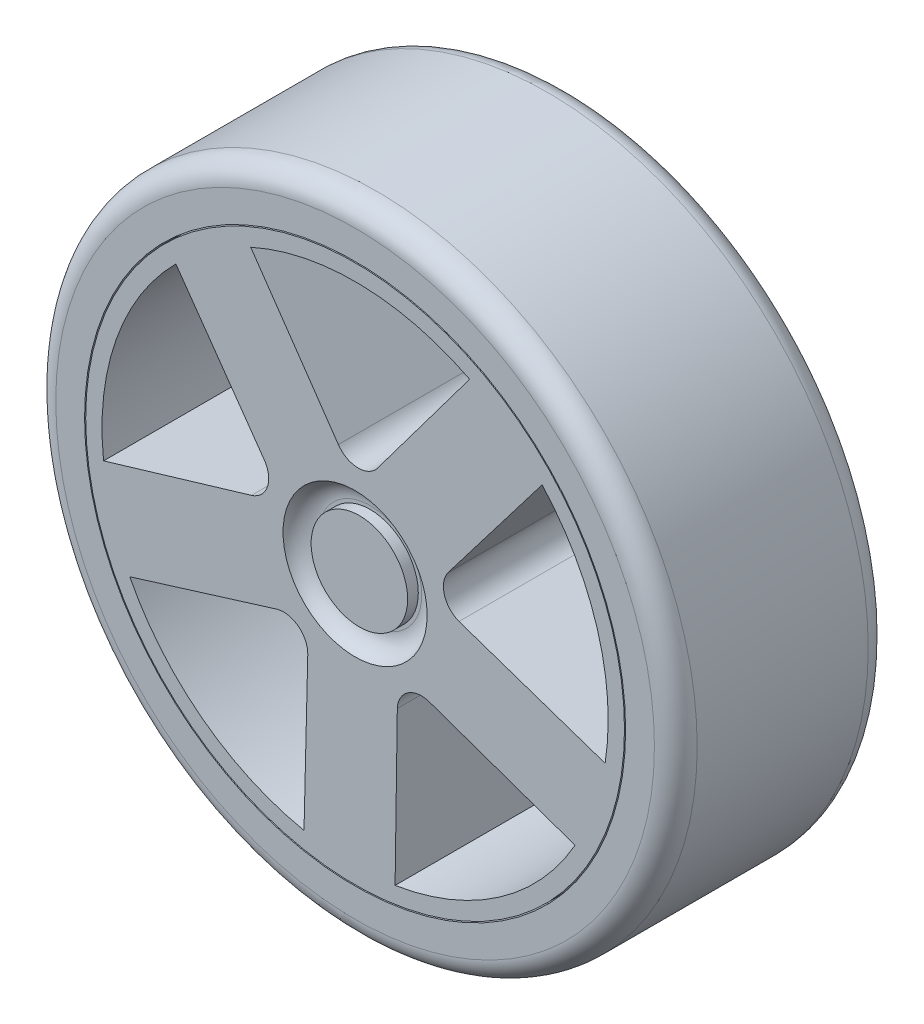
ISO-10303-21;
HEADER;
FILE_DESCRIPTION(('STEP AP214'),'2;1');
FILE_NAME('part.step','',(''),(''),'','','');
FILE_SCHEMA(('AUTOMOTIVE_DESIGN { 1 0 10303 214 1 1 1 1 }'));
ENDSEC;
DATA;
#1=APPLICATION_CONTEXT('core data for automotive mechanical design processes');
#2=APPLICATION_PROTOCOL_DEFINITION('international standard','automotive_design',2000,#1);
#3=PRODUCT_CONTEXT('',#1,'mechanical');
#4=PRODUCT('Part','Part','',(#3));
#5=PRODUCT_RELATED_PRODUCT_CATEGORY('part','',(#4));
#6=PRODUCT_DEFINITION_FORMATION('','',#4);
#7=PRODUCT_DEFINITION_CONTEXT('part definition',#1,'design');
#8=PRODUCT_DEFINITION('design','',#6,#7);
#9=PRODUCT_DEFINITION_SHAPE('','',#8);
#10=(LENGTH_UNIT() NAMED_UNIT(*) SI_UNIT(.MILLI.,.METRE.));
#11=(NAMED_UNIT(*) PLANE_ANGLE_UNIT() SI_UNIT($,.RADIAN.));
#12=(NAMED_UNIT(*) SI_UNIT($,.STERADIAN.) SOLID_ANGLE_UNIT());
#13=UNCERTAINTY_MEASURE_WITH_UNIT(LENGTH_MEASURE(1.E-05),#10,'distance_accuracy_value','');
#14=(GEOMETRIC_REPRESENTATION_CONTEXT(3) GLOBAL_UNCERTAINTY_ASSIGNED_CONTEXT((#13)) GLOBAL_UNIT_ASSIGNED_CONTEXT((#10,
#11,#12)) REPRESENTATION_CONTEXT('',''));
#15=CARTESIAN_POINT('',(0.,0.,0.));
#16=DIRECTION('',(0.,0.,1.));
#17=DIRECTION('',(1.,0.,0.));
#18=AXIS2_PLACEMENT_3D('',#15,#16,#17);
#19=CARTESIAN_POINT('',(0.,0.,25.4));
#20=DIRECTION('',(0.,0.,-1.));
#21=DIRECTION('',(-1.,0.,0.));
#22=AXIS2_PLACEMENT_3D('',#19,#20,#21);
#23=CYLINDRICAL_SURFACE('',#22,32.004);
#24=CARTESIAN_POINT('',(0.,0.,25.4));
#25=DIRECTION('',(0.,0.,1.));
#26=DIRECTION('',(1.,0.,0.));
#27=AXIS2_PLACEMENT_3D('',#24,#25,#26);
#28=CIRCLE('',#27,32.004);
#29=CARTESIAN_POINT('',(32.004,0.,25.4));
#30=VERTEX_POINT('',#29);
#31=EDGE_CURVE('E61',#30,#30,#28,.T.);
#32=ORIENTED_EDGE('',*,*,#31,.F.);
#33=EDGE_LOOP('',(#32));
#34=FACE_BOUND('',#33,.T.);
#35=CARTESIAN_POINT('',(0.,0.,0.));
#36=DIRECTION('',(0.,0.,1.));
#37=DIRECTION('',(1.,0.,0.));
#38=AXIS2_PLACEMENT_3D('',#35,#36,#37);
#39=CIRCLE('',#38,32.004);
#40=CARTESIAN_POINT('',(32.004,0.,0.));
#41=VERTEX_POINT('',#40);
#42=EDGE_CURVE('E401',#41,#41,#39,.T.);
#43=ORIENTED_EDGE('',*,*,#42,.T.);
#44=EDGE_LOOP('',(#43));
#45=FACE_BOUND('',#44,.T.);
#46=ADVANCED_FACE('F52',(#34,#45),#23,.T.);
#47=CARTESIAN_POINT('',(0.,0.,25.4));
#48=DIRECTION('',(0.,0.,1.));
#49=DIRECTION('',(1.,0.,0.));
#50=AXIS2_PLACEMENT_3D('',#47,#48,#49);
#51=PLANE('',#50);
#52=CARTESIAN_POINT('',(0.,0.,25.4));
#53=DIRECTION('',(0.,0.,1.));
#54=DIRECTION('',(1.,0.,0.));
#55=AXIS2_PLACEMENT_3D('',#52,#53,#54);
#56=CIRCLE('',#55,8.5593516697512);
#57=CARTESIAN_POINT('',(8.5593516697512,0.,25.4));
#58=VERTEX_POINT('',#57);
#59=EDGE_CURVE('E340',#58,#58,#56,.T.);
#60=ORIENTED_EDGE('',*,*,#59,.F.);
#61=EDGE_LOOP('',(#60));
#62=FACE_BOUND('',#61,.T.);
#63=CARTESIAN_POINT('',(0.,0.,25.4));
#64=DIRECTION('',(0.,0.,1.));
#65=DIRECTION('',(1.,0.,0.));
#66=AXIS2_PLACEMENT_3D('',#63,#64,#65);
#67=CIRCLE('',#66,30.0663789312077);
#68=CARTESIAN_POINT('',(-21.2941591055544,21.2260672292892,25.4));
#69=VERTEX_POINT('',#68);
#70=CARTESIAN_POINT('',(-29.8816345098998,-3.32792143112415,25.4));
#71=VERTEX_POINT('',#70);
#72=EDGE_CURVE('E68',#69,#71,#67,.T.);
#73=ORIENTED_EDGE('',*,*,#72,.F.);
#74=DIRECTION('',(-0.576069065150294,0.817401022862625,0.));
#75=VECTOR('',#74,1.);
#76=CARTESIAN_POINT('',(-10.7302632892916,6.236650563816,25.4));
#77=LINE('',#76,#75);
#78=CARTESIAN_POINT('',(-10.7302632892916,6.236650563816,25.4));
#79=VERTEX_POINT('',#78);
#80=EDGE_CURVE('E341',#79,#69,#77,.T.);
#81=ORIENTED_EDGE('',*,*,#80,.F.);
#82=CARTESIAN_POINT('',(-13.1276531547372,4.66047215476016,25.4));
#83=DIRECTION('',(0.,0.,1.));
#84=DIRECTION('',(1.,0.,0.));
#85=AXIS2_PLACEMENT_3D('',#82,#83,#84);
#86=CIRCLE('',#85,2.86911424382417);
#87=CARTESIAN_POINT('',(-12.3079916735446,1.91093190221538,25.4));
#88=VERTEX_POINT('',#87);
#89=EDGE_CURVE('E345',#88,#79,#86,.T.);
#90=ORIENTED_EDGE('',*,*,#89,.F.);
#91=DIRECTION('',(0.958323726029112,0.285684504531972,0.));
#92=VECTOR('',#91,1.);
#93=CARTESIAN_POINT('',(-29.8816345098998,-3.32792143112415,25.4));
#94=LINE('',#93,#92);
#95=EDGE_CURVE('E350',#71,#88,#94,.T.);
#96=ORIENTED_EDGE('',*,*,#95,.F.);
#97=EDGE_LOOP('',(#73,#81,#90,#96));
#98=FACE_BOUND('',#97,.T.);
#99=CARTESIAN_POINT('',(0.,0.,25.4));
#100=DIRECTION('',(0.,0.,1.));
#101=DIRECTION('',(1.,0.,0.));
#102=AXIS2_PLACEMENT_3D('',#99,#100,#101);
#103=CIRCLE('',#102,30.0663789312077);
#104=CARTESIAN_POINT('',(-26.7674465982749,-13.6927332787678,25.4));
#105=VERTEX_POINT('',#104);
#106=CARTESIAN_POINT('',(-6.06889152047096,-29.4475074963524,25.4));
#107=VERTEX_POINT('',#106);
#108=EDGE_CURVE('E76',#105,#107,#103,.T.);
#109=ORIENTED_EDGE('',*,*,#108,.F.);
#110=DIRECTION('',(-0.955409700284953,-0.295283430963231,0.));
#111=VECTOR('',#110,1.);
#112=CARTESIAN_POINT('',(-9.24724086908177,-8.27785581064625,25.4));
#113=LINE('',#112,#111);
#114=CARTESIAN_POINT('',(-9.24724086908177,-8.27785581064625,25.4));
#115=VERTEX_POINT('',#114);
#116=EDGE_CURVE('E298',#115,#105,#113,.T.);
#117=ORIENTED_EDGE('',*,*,#116,.F.);
#118=CARTESIAN_POINT('',(-8.48904033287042,-11.0449749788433,25.4));
#119=DIRECTION('',(0.,0.,1.));
#120=DIRECTION('',(1.,0.,0.));
#121=AXIS2_PLACEMENT_3D('',#118,#119,#120);
#122=CIRCLE('',#121,2.86911424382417);
#123=CARTESIAN_POINT('',(-5.62078283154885,-11.1150852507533,25.4));
#124=VERTEX_POINT('',#123);
#125=EDGE_CURVE('E302',#124,#115,#122,.T.);
#126=ORIENTED_EDGE('',*,*,#125,.F.);
#127=DIRECTION('',(0.02443620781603,0.999701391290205,0.));
#128=VECTOR('',#127,1.);
#129=CARTESIAN_POINT('',(-6.06889152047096,-29.4475074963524,25.4));
#130=LINE('',#129,#128);
#131=EDGE_CURVE('E307',#107,#124,#130,.T.);
#132=ORIENTED_EDGE('',*,*,#131,.F.);
#133=EDGE_LOOP('',(#109,#117,#126,#132));
#134=FACE_BOUND('',#133,.T.);
#135=CARTESIAN_POINT('',(0.,0.,25.4));
#136=DIRECTION('',(0.,0.,1.));
#137=DIRECTION('',(1.,0.,0.));
#138=AXIS2_PLACEMENT_3D('',#135,#136,#137);
#139=CIRCLE('',#138,30.0663789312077);
#140=CARTESIAN_POINT('',(4.75096731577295,-29.6886417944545,25.4));
#141=VERTEX_POINT('',#140);
#142=CARTESIAN_POINT('',(26.1308532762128,-14.8716390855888,25.4));
#143=VERTEX_POINT('',#142);
#144=EDGE_CURVE('E202',#141,#143,#139,.T.);
#145=ORIENTED_EDGE('',*,*,#144,.F.);
#146=DIRECTION('',(-0.0144066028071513,-0.999896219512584,0.));
#147=VECTOR('',#146,1.);
#148=CARTESIAN_POINT('',(5.01515413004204,-11.3526468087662,25.4));
#149=LINE('',#148,#147);
#150=CARTESIAN_POINT('',(5.01515413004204,-11.3526468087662,25.4));
#151=VERTEX_POINT('',#150);
#152=EDGE_CURVE('E256',#151,#141,#149,.T.);
#153=ORIENTED_EDGE('',*,*,#152,.F.);
#154=CARTESIAN_POINT('',(7.88113769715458,-11.4866420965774,25.4));
#155=DIRECTION('',(0.,0.,1.));
#156=DIRECTION('',(1.,0.,0.));
#157=AXIS2_PLACEMENT_3D('',#154,#155,#156);
#158=CIRCLE('',#157,2.86911424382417);
#159=CARTESIAN_POINT('',(8.8341568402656,-8.78043237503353,25.4));
#160=VERTEX_POINT('',#159);
#161=EDGE_CURVE('E260',#160,#151,#158,.T.);
#162=ORIENTED_EDGE('',*,*,#161,.F.);
#163=DIRECTION('',(-0.943221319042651,0.332164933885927,0.));
#164=VECTOR('',#163,1.);
#165=CARTESIAN_POINT('',(26.1308532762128,-14.8716390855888,25.4));
#166=LINE('',#165,#164);
#167=EDGE_CURVE('E265',#143,#160,#166,.T.);
#168=ORIENTED_EDGE('',*,*,#167,.F.);
#169=EDGE_LOOP('',(#145,#153,#162,#168));
#170=FACE_BOUND('',#169,.T.);
#171=CARTESIAN_POINT('',(0.,0.,25.4));
#172=DIRECTION('',(0.,0.,1.));
#173=DIRECTION('',(1.,0.,0.));
#174=AXIS2_PLACEMENT_3D('',#171,#172,#173);
#175=CIRCLE('',#174,30.0663789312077);
#176=CARTESIAN_POINT('',(29.7037058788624,-4.65585643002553,25.4));
#177=VERTEX_POINT('',#176);
#178=CARTESIAN_POINT('',(22.2186470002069,20.2563290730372,25.4));
#179=VERTEX_POINT('',#178);
#180=EDGE_CURVE('E193',#177,#179,#175,.T.);
#181=ORIENTED_EDGE('',*,*,#180,.F.);
#182=DIRECTION('',(0.946505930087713,-0.322686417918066,0.));
#183=VECTOR('',#182,1.);
#184=CARTESIAN_POINT('',(12.3467765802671,1.26153422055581,25.4));
#185=LINE('',#184,#183);
#186=CARTESIAN_POINT('',(12.3467765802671,1.26153422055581,25.4));
#187=VERTEX_POINT('',#186);
#188=EDGE_CURVE('E205',#187,#177,#185,.T.);
#189=ORIENTED_EDGE('',*,*,#188,.F.);
#190=CARTESIAN_POINT('',(13.35985129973,3.94583974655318,25.4));
#191=DIRECTION('',(0.,0.,1.));
#192=DIRECTION('',(1.,0.,0.));
#193=AXIS2_PLACEMENT_3D('',#190,#191,#192);
#194=CIRCLE('',#193,2.86911424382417);
#195=CARTESIAN_POINT('',(11.0805920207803,5.6884796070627,25.4));
#196=VERTEX_POINT('',#195);
#197=EDGE_CURVE('E211',#196,#187,#194,.T.);
#198=ORIENTED_EDGE('',*,*,#197,.F.);
#199=DIRECTION('',(-0.607379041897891,-0.794412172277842,0.));
#200=VECTOR('',#199,1.);
#201=CARTESIAN_POINT('',(22.2186470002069,20.2563290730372,25.4));
#202=LINE('',#201,#200);
#203=EDGE_CURVE('E217',#179,#196,#202,.T.);
#204=ORIENTED_EDGE('',*,*,#203,.F.);
#205=EDGE_LOOP('',(#181,#189,#198,#204));
#206=FACE_BOUND('',#205,.T.);
#207=CARTESIAN_POINT('',(0.,0.,25.4));
#208=DIRECTION('',(0.,0.,1.));
#209=DIRECTION('',(1.,0.,0.));
#210=AXIS2_PLACEMENT_3D('',#207,#208,#209);
#211=CIRCLE('',#210,30.0663789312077);
#212=CARTESIAN_POINT('',(13.6069325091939,26.811164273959,25.4));
#213=VERTEX_POINT('',#212);
#214=CARTESIAN_POINT('',(-12.3989742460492,27.3907389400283,25.4));
#215=VERTEX_POINT('',#214);
#216=EDGE_CURVE('E219',#213,#215,#211,.T.);
#217=ORIENTED_EDGE('',*,*,#216,.F.);
#218=DIRECTION('',(0.599379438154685,0.800465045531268,0.));
#219=VECTOR('',#218,1.);
#220=CARTESIAN_POINT('',(2.61557344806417,12.1323178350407,25.4));
#221=LINE('',#220,#219);
#222=CARTESIAN_POINT('',(2.61557344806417,12.1323178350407,25.4));
#223=VERTEX_POINT('',#222);
#224=EDGE_CURVE('E375',#223,#213,#221,.T.);
#225=ORIENTED_EDGE('',*,*,#224,.F.);
#226=CARTESIAN_POINT('',(0.375704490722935,13.9253051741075,25.4));
#227=DIRECTION('',(0.,0.,1.));
#228=DIRECTION('',(1.,0.,0.));
#229=AXIS2_PLACEMENT_3D('',#226,#227,#228);
#230=CIRCLE('',#229,2.86911424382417);
#231=CARTESIAN_POINT('',(-1.98597435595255,12.2961061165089,25.4));
#232=VERTEX_POINT('',#231);
#233=EDGE_CURVE('E391',#232,#223,#230,.T.);
#234=ORIENTED_EDGE('',*,*,#233,.F.);
#235=DIRECTION('',(0.567840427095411,-0.823138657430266,0.));
#236=VECTOR('',#235,1.);
#237=CARTESIAN_POINT('',(-12.3989742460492,27.3907389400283,25.4));
#238=LINE('',#237,#236);
#239=EDGE_CURVE('E223',#215,#232,#238,.T.);
#240=ORIENTED_EDGE('',*,*,#239,.F.);
#241=EDGE_LOOP('',(#217,#225,#234,#240));
#242=FACE_BOUND('',#241,.T.);
#243=ORIENTED_EDGE('',*,*,#31,.T.);
#244=EDGE_LOOP('',(#243));
#245=FACE_BOUND('',#244,.T.);
#246=ADVANCED_FACE('F214',(#62,#98,#134,#170,#206,#242,#245),#51,.T.);
#247=CARTESIAN_POINT('',(0.,0.,0.));
#248=DIRECTION('',(0.,0.,1.));
#249=DIRECTION('',(1.,0.,0.));
#250=AXIS2_PLACEMENT_3D('',#247,#248,#249);
#251=PLANE('',#250);
#252=CARTESIAN_POINT('',(0.,0.,0.));
#253=DIRECTION('',(0.,0.,-1.));
#254=DIRECTION('',(-1.,0.,0.));
#255=AXIS2_PLACEMENT_3D('',#252,#253,#254);
#256=CIRCLE('',#255,1.778);
#257=CARTESIAN_POINT('',(-1.778,0.,0.));
#258=VERTEX_POINT('',#257);
#259=EDGE_CURVE('E764',#258,#258,#256,.T.);
#260=ORIENTED_EDGE('',*,*,#259,.F.);
#261=EDGE_LOOP('',(#260));
#262=FACE_BOUND('',#261,.T.);
#263=DIRECTION('',(-0.576069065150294,0.817401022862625,0.));
#264=VECTOR('',#263,1.);
#265=CARTESIAN_POINT('',(-10.7302632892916,6.236650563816,0.));
#266=LINE('',#265,#264);
#267=CARTESIAN_POINT('',(-10.7302632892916,6.236650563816,0.));
#268=VERTEX_POINT('',#267);
#269=CARTESIAN_POINT('',(-21.2941591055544,21.2260672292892,0.));
#270=VERTEX_POINT('',#269);
#271=EDGE_CURVE('E330',#268,#270,#266,.T.);
#272=ORIENTED_EDGE('',*,*,#271,.T.);
#273=CARTESIAN_POINT('',(0.,0.,0.));
#274=DIRECTION('',(0.,0.,1.));
#275=DIRECTION('',(1.,0.,0.));
#276=AXIS2_PLACEMENT_3D('',#273,#274,#275);
#277=CIRCLE('',#276,30.0663789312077);
#278=CARTESIAN_POINT('',(-29.8816345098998,-3.32792143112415,0.));
#279=VERTEX_POINT('',#278);
#280=EDGE_CURVE('E346',#270,#279,#277,.T.);
#281=ORIENTED_EDGE('',*,*,#280,.T.);
#282=DIRECTION('',(0.958323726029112,0.285684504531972,0.));
#283=VECTOR('',#282,1.);
#284=CARTESIAN_POINT('',(-29.8816345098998,-3.32792143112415,0.));
#285=LINE('',#284,#283);
#286=CARTESIAN_POINT('',(-12.3079916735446,1.91093190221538,0.));
#287=VERTEX_POINT('',#286);
#288=EDGE_CURVE('E363',#279,#287,#285,.T.);
#289=ORIENTED_EDGE('',*,*,#288,.T.);
#290=CARTESIAN_POINT('',(-13.1276531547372,4.66047215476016,0.));
#291=DIRECTION('',(0.,0.,1.));
#292=DIRECTION('',(1.,0.,0.));
#293=AXIS2_PLACEMENT_3D('',#290,#291,#292);
#294=CIRCLE('',#293,2.86911424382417);
#295=EDGE_CURVE('E359',#287,#268,#294,.T.);
#296=ORIENTED_EDGE('',*,*,#295,.T.);
#297=EDGE_LOOP('',(#272,#281,#289,#296));
#298=FACE_BOUND('',#297,.T.);
#299=DIRECTION('',(-0.955409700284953,-0.295283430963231,0.));
#300=VECTOR('',#299,1.);
#301=CARTESIAN_POINT('',(-9.24724086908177,-8.27785581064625,0.));
#302=LINE('',#301,#300);
#303=CARTESIAN_POINT('',(-9.24724086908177,-8.27785581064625,0.));
#304=VERTEX_POINT('',#303);
#305=CARTESIAN_POINT('',(-26.7674465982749,-13.6927332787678,0.));
#306=VERTEX_POINT('',#305);
#307=EDGE_CURVE('E288',#304,#306,#302,.T.);
#308=ORIENTED_EDGE('',*,*,#307,.T.);
#309=CARTESIAN_POINT('',(0.,0.,0.));
#310=DIRECTION('',(0.,0.,1.));
#311=DIRECTION('',(1.,0.,0.));
#312=AXIS2_PLACEMENT_3D('',#309,#310,#311);
#313=CIRCLE('',#312,30.0663789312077);
#314=CARTESIAN_POINT('',(-6.06889152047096,-29.4475074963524,0.));
#315=VERTEX_POINT('',#314);
#316=EDGE_CURVE('E303',#306,#315,#313,.T.);
#317=ORIENTED_EDGE('',*,*,#316,.T.);
#318=DIRECTION('',(0.02443620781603,0.999701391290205,0.));
#319=VECTOR('',#318,1.);
#320=CARTESIAN_POINT('',(-6.06889152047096,-29.4475074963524,0.));
#321=LINE('',#320,#319);
#322=CARTESIAN_POINT('',(-5.62078283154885,-11.1150852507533,0.));
#323=VERTEX_POINT('',#322);
#324=EDGE_CURVE('E320',#315,#323,#321,.T.);
#325=ORIENTED_EDGE('',*,*,#324,.T.);
#326=CARTESIAN_POINT('',(-8.48904033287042,-11.0449749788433,0.));
#327=DIRECTION('',(0.,0.,1.));
#328=DIRECTION('',(1.,0.,0.));
#329=AXIS2_PLACEMENT_3D('',#326,#327,#328);
#330=CIRCLE('',#329,2.86911424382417);
#331=EDGE_CURVE('E316',#323,#304,#330,.T.);
#332=ORIENTED_EDGE('',*,*,#331,.T.);
#333=EDGE_LOOP('',(#308,#317,#325,#332));
#334=FACE_BOUND('',#333,.T.);
#335=DIRECTION('',(-0.0144066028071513,-0.999896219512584,0.));
#336=VECTOR('',#335,1.);
#337=CARTESIAN_POINT('',(5.01515413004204,-11.3526468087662,0.));
#338=LINE('',#337,#336);
#339=CARTESIAN_POINT('',(5.01515413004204,-11.3526468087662,0.));
#340=VERTEX_POINT('',#339);
#341=CARTESIAN_POINT('',(4.75096731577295,-29.6886417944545,0.));
#342=VERTEX_POINT('',#341);
#343=EDGE_CURVE('E246',#340,#342,#338,.T.);
#344=ORIENTED_EDGE('',*,*,#343,.T.);
#345=CARTESIAN_POINT('',(0.,0.,0.));
#346=DIRECTION('',(0.,0.,1.));
#347=DIRECTION('',(1.,0.,0.));
#348=AXIS2_PLACEMENT_3D('',#345,#346,#347);
#349=CIRCLE('',#348,30.0663789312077);
#350=CARTESIAN_POINT('',(26.1308532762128,-14.8716390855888,0.));
#351=VERTEX_POINT('',#350);
#352=EDGE_CURVE('E261',#342,#351,#349,.T.);
#353=ORIENTED_EDGE('',*,*,#352,.T.);
#354=DIRECTION('',(-0.943221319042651,0.332164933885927,0.));
#355=VECTOR('',#354,1.);
#356=CARTESIAN_POINT('',(26.1308532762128,-14.8716390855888,0.));
#357=LINE('',#356,#355);
#358=CARTESIAN_POINT('',(8.83415684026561,-8.78043237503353,0.));
#359=VERTEX_POINT('',#358);
#360=EDGE_CURVE('E278',#351,#359,#357,.T.);
#361=ORIENTED_EDGE('',*,*,#360,.T.);
#362=CARTESIAN_POINT('',(7.88113769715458,-11.4866420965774,0.));
#363=DIRECTION('',(0.,0.,1.));
#364=DIRECTION('',(1.,0.,0.));
#365=AXIS2_PLACEMENT_3D('',#362,#363,#364);
#366=CIRCLE('',#365,2.86911424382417);
#367=EDGE_CURVE('E274',#359,#340,#366,.T.);
#368=ORIENTED_EDGE('',*,*,#367,.T.);
#369=EDGE_LOOP('',(#344,#353,#361,#368));
#370=FACE_BOUND('',#369,.T.);
#371=DIRECTION('',(0.946505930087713,-0.322686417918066,0.));
#372=VECTOR('',#371,1.);
#373=CARTESIAN_POINT('',(12.3467765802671,1.26153422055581,0.));
#374=LINE('',#373,#372);
#375=CARTESIAN_POINT('',(12.3467765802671,1.26153422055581,0.));
#376=VERTEX_POINT('',#375);
#377=CARTESIAN_POINT('',(29.7037058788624,-4.65585643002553,0.));
#378=VERTEX_POINT('',#377);
#379=EDGE_CURVE('E228',#376,#378,#374,.T.);
#380=ORIENTED_EDGE('',*,*,#379,.T.);
#381=CARTESIAN_POINT('',(0.,0.,0.));
#382=DIRECTION('',(0.,0.,1.));
#383=DIRECTION('',(1.,0.,0.));
#384=AXIS2_PLACEMENT_3D('',#381,#382,#383);
#385=CIRCLE('',#384,30.0663789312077);
#386=CARTESIAN_POINT('',(22.2186470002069,20.2563290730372,0.));
#387=VERTEX_POINT('',#386);
#388=EDGE_CURVE('E196',#378,#387,#385,.T.);
#389=ORIENTED_EDGE('',*,*,#388,.T.);
#390=DIRECTION('',(-0.607379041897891,-0.794412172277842,0.));
#391=VECTOR('',#390,1.);
#392=CARTESIAN_POINT('',(22.2186470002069,20.2563290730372,0.));
#393=LINE('',#392,#391);
#394=CARTESIAN_POINT('',(11.0805920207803,5.6884796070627,0.));
#395=VERTEX_POINT('',#394);
#396=EDGE_CURVE('E236',#387,#395,#393,.T.);
#397=ORIENTED_EDGE('',*,*,#396,.T.);
#398=CARTESIAN_POINT('',(13.35985129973,3.94583974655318,0.));
#399=DIRECTION('',(0.,0.,1.));
#400=DIRECTION('',(1.,0.,0.));
#401=AXIS2_PLACEMENT_3D('',#398,#399,#400);
#402=CIRCLE('',#401,2.86911424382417);
#403=EDGE_CURVE('E231',#395,#376,#402,.T.);
#404=ORIENTED_EDGE('',*,*,#403,.T.);
#405=EDGE_LOOP('',(#380,#389,#397,#404));
#406=FACE_BOUND('',#405,.T.);
#407=DIRECTION('',(0.599379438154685,0.800465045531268,0.));
#408=VECTOR('',#407,1.);
#409=CARTESIAN_POINT('',(2.61557344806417,12.1323178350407,0.));
#410=LINE('',#409,#408);
#411=CARTESIAN_POINT('',(2.61557344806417,12.1323178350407,0.));
#412=VERTEX_POINT('',#411);
#413=CARTESIAN_POINT('',(13.6069325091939,26.811164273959,0.));
#414=VERTEX_POINT('',#413);
#415=EDGE_CURVE('E383',#412,#414,#410,.T.);
#416=ORIENTED_EDGE('',*,*,#415,.T.);
#417=CARTESIAN_POINT('',(0.,0.,0.));
#418=DIRECTION('',(0.,0.,1.));
#419=DIRECTION('',(1.,0.,0.));
#420=AXIS2_PLACEMENT_3D('',#417,#418,#419);
#421=CIRCLE('',#420,30.0663789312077);
#422=CARTESIAN_POINT('',(-12.3989742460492,27.3907389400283,0.));
#423=VERTEX_POINT('',#422);
#424=EDGE_CURVE('E370',#414,#423,#421,.T.);
#425=ORIENTED_EDGE('',*,*,#424,.T.);
#426=DIRECTION('',(0.567840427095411,-0.823138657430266,0.));
#427=VECTOR('',#426,1.);
#428=CARTESIAN_POINT('',(-12.3989742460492,27.3907389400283,0.));
#429=LINE('',#428,#427);
#430=CARTESIAN_POINT('',(-1.98597435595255,12.2961061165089,0.));
#431=VERTEX_POINT('',#430);
#432=EDGE_CURVE('E374',#423,#431,#429,.T.);
#433=ORIENTED_EDGE('',*,*,#432,.T.);
#434=CARTESIAN_POINT('',(0.375704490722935,13.9253051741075,0.));
#435=DIRECTION('',(0.,0.,1.));
#436=DIRECTION('',(1.,0.,0.));
#437=AXIS2_PLACEMENT_3D('',#434,#435,#436);
#438=CIRCLE('',#437,2.86911424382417);
#439=EDGE_CURVE('E379',#431,#412,#438,.T.);
#440=ORIENTED_EDGE('',*,*,#439,.T.);
#441=EDGE_LOOP('',(#416,#425,#433,#440));
#442=FACE_BOUND('',#441,.T.);
#443=ORIENTED_EDGE('',*,*,#42,.F.);
#444=EDGE_LOOP('',(#443));
#445=FACE_BOUND('',#444,.T.);
#446=ADVANCED_FACE('F418',(#262,#298,#334,#370,#406,#442,#445),#251,.F.);
#447=CARTESIAN_POINT('',(0.,0.,0.));
#448=DIRECTION('',(0.,0.,1.));
#449=DIRECTION('',(1.,0.,0.));
#450=AXIS2_PLACEMENT_3D('',#447,#448,#449);
#451=CYLINDRICAL_SURFACE('',#450,30.0663789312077);
#452=ORIENTED_EDGE('',*,*,#216,.T.);
#453=DIRECTION('',(0.,0.,1.));
#454=VECTOR('',#453,1.);
#455=CARTESIAN_POINT('',(-12.3989742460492,27.3907389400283,0.));
#456=LINE('',#455,#454);
#457=EDGE_CURVE('E386',#423,#215,#456,.T.);
#458=ORIENTED_EDGE('',*,*,#457,.F.);
#459=ORIENTED_EDGE('',*,*,#424,.F.);
#460=DIRECTION('',(0.,0.,1.));
#461=VECTOR('',#460,1.);
#462=CARTESIAN_POINT('',(13.6069325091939,26.811164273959,0.));
#463=LINE('',#462,#461);
#464=EDGE_CURVE('E398',#414,#213,#463,.T.);
#465=ORIENTED_EDGE('',*,*,#464,.T.);
#466=EDGE_LOOP('',(#452,#458,#459,#465));
#467=FACE_BOUND('',#466,.T.);
#468=ADVANCED_FACE('F420',(#467),#451,.F.);
#469=CARTESIAN_POINT('',(2.61557344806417,12.1323178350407,0.));
#470=DIRECTION('',(0.800465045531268,-0.599379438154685,0.));
#471=DIRECTION('',(0.599379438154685,0.800465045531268,0.));
#472=AXIS2_PLACEMENT_3D('',#469,#470,#471);
#473=PLANE('',#472);
#474=ORIENTED_EDGE('',*,*,#224,.T.);
#475=ORIENTED_EDGE('',*,*,#464,.F.);
#476=ORIENTED_EDGE('',*,*,#415,.F.);
#477=DIRECTION('',(0.,0.,1.));
#478=VECTOR('',#477,1.);
#479=CARTESIAN_POINT('',(2.61557344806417,12.1323178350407,0.));
#480=LINE('',#479,#478);
#481=EDGE_CURVE('E402',#412,#223,#480,.T.);
#482=ORIENTED_EDGE('',*,*,#481,.T.);
#483=EDGE_LOOP('',(#474,#475,#476,#482));
#484=FACE_BOUND('',#483,.T.);
#485=ADVANCED_FACE('F428',(#484),#473,.F.);
#486=CARTESIAN_POINT('',(0.375704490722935,13.9253051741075,0.));
#487=DIRECTION('',(0.,0.,1.));
#488=DIRECTION('',(1.,0.,0.));
#489=AXIS2_PLACEMENT_3D('',#486,#487,#488);
#490=CYLINDRICAL_SURFACE('',#489,2.86911424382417);
#491=ORIENTED_EDGE('',*,*,#233,.T.);
#492=ORIENTED_EDGE('',*,*,#481,.F.);
#493=ORIENTED_EDGE('',*,*,#439,.F.);
#494=DIRECTION('',(0.,0.,1.));
#495=VECTOR('',#494,1.);
#496=CARTESIAN_POINT('',(-1.98597435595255,12.2961061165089,0.));
#497=LINE('',#496,#495);
#498=EDGE_CURVE('E405',#431,#232,#497,.T.);
#499=ORIENTED_EDGE('',*,*,#498,.T.);
#500=EDGE_LOOP('',(#491,#492,#493,#499));
#501=FACE_BOUND('',#500,.T.);
#502=ADVANCED_FACE('F463',(#501),#490,.F.);
#503=CARTESIAN_POINT('',(-12.3989742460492,27.3907389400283,0.));
#504=DIRECTION('',(-0.823138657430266,-0.567840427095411,0.));
#505=DIRECTION('',(0.567840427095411,-0.823138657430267,0.));
#506=AXIS2_PLACEMENT_3D('',#503,#504,#505);
#507=PLANE('',#506);
#508=ORIENTED_EDGE('',*,*,#239,.T.);
#509=ORIENTED_EDGE('',*,*,#498,.F.);
#510=ORIENTED_EDGE('',*,*,#432,.F.);
#511=ORIENTED_EDGE('',*,*,#457,.T.);
#512=EDGE_LOOP('',(#508,#509,#510,#511));
#513=FACE_BOUND('',#512,.T.);
#514=ADVANCED_FACE('F471',(#513),#507,.F.);
#515=CARTESIAN_POINT('',(0.,0.,0.));
#516=DIRECTION('',(0.,0.,1.));
#517=DIRECTION('',(1.,0.,0.));
#518=AXIS2_PLACEMENT_3D('',#515,#516,#517);
#519=CYLINDRICAL_SURFACE('',#518,30.0663789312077);
#520=ORIENTED_EDGE('',*,*,#180,.T.);
#521=DIRECTION('',(0.,0.,1.));
#522=VECTOR('',#521,1.);
#523=CARTESIAN_POINT('',(22.2186470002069,20.2563290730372,0.));
#524=LINE('',#523,#522);
#525=EDGE_CURVE('E232',#387,#179,#524,.T.);
#526=ORIENTED_EDGE('',*,*,#525,.F.);
#527=ORIENTED_EDGE('',*,*,#388,.F.);
#528=DIRECTION('',(0.,0.,1.));
#529=VECTOR('',#528,1.);
#530=CARTESIAN_POINT('',(29.7037058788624,-4.65585643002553,0.));
#531=LINE('',#530,#529);
#532=EDGE_CURVE('E189',#378,#177,#531,.T.);
#533=ORIENTED_EDGE('',*,*,#532,.T.);
#534=EDGE_LOOP('',(#520,#526,#527,#533));
#535=FACE_BOUND('',#534,.T.);
#536=ADVANCED_FACE('F191',(#535),#519,.F.);
#537=CARTESIAN_POINT('',(12.3467765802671,1.26153422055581,0.));
#538=DIRECTION('',(-0.322686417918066,-0.946505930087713,0.));
#539=DIRECTION('',(0.946505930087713,-0.322686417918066,0.));
#540=AXIS2_PLACEMENT_3D('',#537,#538,#539);
#541=PLANE('',#540);
#542=ORIENTED_EDGE('',*,*,#188,.T.);
#543=ORIENTED_EDGE('',*,*,#532,.F.);
#544=ORIENTED_EDGE('',*,*,#379,.F.);
#545=DIRECTION('',(0.,0.,1.));
#546=VECTOR('',#545,1.);
#547=CARTESIAN_POINT('',(12.3467765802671,1.26153422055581,0.));
#548=LINE('',#547,#546);
#549=EDGE_CURVE('E201',#376,#187,#548,.T.);
#550=ORIENTED_EDGE('',*,*,#549,.T.);
#551=EDGE_LOOP('',(#542,#543,#544,#550));
#552=FACE_BOUND('',#551,.T.);
#553=ADVANCED_FACE('F206',(#552),#541,.F.);
#554=CARTESIAN_POINT('',(13.35985129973,3.94583974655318,0.));
#555=DIRECTION('',(0.,0.,1.));
#556=DIRECTION('',(1.,0.,0.));
#557=AXIS2_PLACEMENT_3D('',#554,#555,#556);
#558=CYLINDRICAL_SURFACE('',#557,2.86911424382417);
#559=ORIENTED_EDGE('',*,*,#197,.T.);
#560=ORIENTED_EDGE('',*,*,#549,.F.);
#561=ORIENTED_EDGE('',*,*,#403,.F.);
#562=DIRECTION('',(0.,0.,1.));
#563=VECTOR('',#562,1.);
#564=CARTESIAN_POINT('',(11.0805920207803,5.6884796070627,0.));
#565=LINE('',#564,#563);
#566=EDGE_CURVE('E782',#395,#196,#565,.T.);
#567=ORIENTED_EDGE('',*,*,#566,.T.);
#568=EDGE_LOOP('',(#559,#560,#561,#567));
#569=FACE_BOUND('',#568,.T.);
#570=ADVANCED_FACE('F492',(#569),#558,.F.);
#571=CARTESIAN_POINT('',(22.2186470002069,20.2563290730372,0.));
#572=DIRECTION('',(-0.794412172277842,0.607379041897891,0.));
#573=DIRECTION('',(-0.607379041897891,-0.794412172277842,0.));
#574=AXIS2_PLACEMENT_3D('',#571,#572,#573);
#575=PLANE('',#574);
#576=ORIENTED_EDGE('',*,*,#203,.T.);
#577=ORIENTED_EDGE('',*,*,#566,.F.);
#578=ORIENTED_EDGE('',*,*,#396,.F.);
#579=ORIENTED_EDGE('',*,*,#525,.T.);
#580=EDGE_LOOP('',(#576,#577,#578,#579));
#581=FACE_BOUND('',#580,.T.);
#582=ADVANCED_FACE('F499',(#581),#575,.F.);
#583=CARTESIAN_POINT('',(0.,0.,0.));
#584=DIRECTION('',(0.,0.,1.));
#585=DIRECTION('',(1.,0.,0.));
#586=AXIS2_PLACEMENT_3D('',#583,#584,#585);
#587=CYLINDRICAL_SURFACE('',#586,30.0663789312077);
#588=ORIENTED_EDGE('',*,*,#144,.T.);
#589=DIRECTION('',(0.,0.,1.));
#590=VECTOR('',#589,1.);
#591=CARTESIAN_POINT('',(26.1308532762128,-14.8716390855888,0.));
#592=LINE('',#591,#590);
#593=EDGE_CURVE('E242',#351,#143,#592,.T.);
#594=ORIENTED_EDGE('',*,*,#593,.F.);
#595=ORIENTED_EDGE('',*,*,#352,.F.);
#596=DIRECTION('',(0.,0.,1.));
#597=VECTOR('',#596,1.);
#598=CARTESIAN_POINT('',(4.75096731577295,-29.6886417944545,0.));
#599=LINE('',#598,#597);
#600=EDGE_CURVE('E253',#342,#141,#599,.T.);
#601=ORIENTED_EDGE('',*,*,#600,.T.);
#602=EDGE_LOOP('',(#588,#594,#595,#601));
#603=FACE_BOUND('',#602,.T.);
#604=ADVANCED_FACE('F507',(#603),#587,.F.);
#605=CARTESIAN_POINT('',(5.01515413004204,-11.3526468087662,0.));
#606=DIRECTION('',(-0.999896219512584,0.0144066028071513,0.));
#607=DIRECTION('',(-0.0144066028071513,-0.999896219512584,0.));
#608=AXIS2_PLACEMENT_3D('',#605,#606,#607);
#609=PLANE('',#608);
#610=ORIENTED_EDGE('',*,*,#152,.T.);
#611=ORIENTED_EDGE('',*,*,#600,.F.);
#612=ORIENTED_EDGE('',*,*,#343,.F.);
#613=DIRECTION('',(0.,0.,1.));
#614=VECTOR('',#613,1.);
#615=CARTESIAN_POINT('',(5.01515413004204,-11.3526468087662,0.));
#616=LINE('',#615,#614);
#617=EDGE_CURVE('E250',#340,#151,#616,.T.);
#618=ORIENTED_EDGE('',*,*,#617,.T.);
#619=EDGE_LOOP('',(#610,#611,#612,#618));
#620=FACE_BOUND('',#619,.T.);
#621=ADVANCED_FACE('F515',(#620),#609,.F.);
#622=CARTESIAN_POINT('',(7.88113769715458,-11.4866420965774,0.));
#623=DIRECTION('',(0.,0.,1.));
#624=DIRECTION('',(1.,0.,0.));
#625=AXIS2_PLACEMENT_3D('',#622,#623,#624);
#626=CYLINDRICAL_SURFACE('',#625,2.86911424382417);
#627=ORIENTED_EDGE('',*,*,#161,.T.);
#628=ORIENTED_EDGE('',*,*,#617,.F.);
#629=ORIENTED_EDGE('',*,*,#367,.F.);
#630=DIRECTION('',(0.,0.,1.));
#631=VECTOR('',#630,1.);
#632=CARTESIAN_POINT('',(8.8341568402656,-8.78043237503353,0.));
#633=LINE('',#632,#631);
#634=EDGE_CURVE('E247',#359,#160,#633,.T.);
#635=ORIENTED_EDGE('',*,*,#634,.T.);
#636=EDGE_LOOP('',(#627,#628,#629,#635));
#637=FACE_BOUND('',#636,.T.);
#638=ADVANCED_FACE('F523',(#637),#626,.F.);
#639=CARTESIAN_POINT('',(26.1308532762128,-14.8716390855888,0.));
#640=DIRECTION('',(0.332164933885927,0.94322131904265,0.));
#641=DIRECTION('',(-0.94322131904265,0.332164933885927,0.));
#642=AXIS2_PLACEMENT_3D('',#639,#640,#641);
#643=PLANE('',#642);
#644=ORIENTED_EDGE('',*,*,#167,.T.);
#645=ORIENTED_EDGE('',*,*,#634,.F.);
#646=ORIENTED_EDGE('',*,*,#360,.F.);
#647=ORIENTED_EDGE('',*,*,#593,.T.);
#648=EDGE_LOOP('',(#644,#645,#646,#647));
#649=FACE_BOUND('',#648,.T.);
#650=ADVANCED_FACE('F531',(#649),#643,.F.);
#651=CARTESIAN_POINT('',(0.,0.,0.));
#652=DIRECTION('',(0.,0.,1.));
#653=DIRECTION('',(1.,0.,0.));
#654=AXIS2_PLACEMENT_3D('',#651,#652,#653);
#655=CYLINDRICAL_SURFACE('',#654,30.0663789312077);
#656=ORIENTED_EDGE('',*,*,#108,.T.);
#657=DIRECTION('',(0.,0.,1.));
#658=VECTOR('',#657,1.);
#659=CARTESIAN_POINT('',(-6.06889152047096,-29.4475074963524,0.));
#660=LINE('',#659,#658);
#661=EDGE_CURVE('E285',#315,#107,#660,.T.);
#662=ORIENTED_EDGE('',*,*,#661,.F.);
#663=ORIENTED_EDGE('',*,*,#316,.F.);
#664=DIRECTION('',(0.,0.,1.));
#665=VECTOR('',#664,1.);
#666=CARTESIAN_POINT('',(-26.7674465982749,-13.6927332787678,0.));
#667=LINE('',#666,#665);
#668=EDGE_CURVE('E295',#306,#105,#667,.T.);
#669=ORIENTED_EDGE('',*,*,#668,.T.);
#670=EDGE_LOOP('',(#656,#662,#663,#669));
#671=FACE_BOUND('',#670,.T.);
#672=ADVANCED_FACE('F539',(#671),#655,.F.);
#673=CARTESIAN_POINT('',(-9.24724086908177,-8.27785581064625,0.));
#674=DIRECTION('',(-0.295283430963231,0.955409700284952,0.));
#675=DIRECTION('',(-0.955409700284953,-0.295283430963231,0.));
#676=AXIS2_PLACEMENT_3D('',#673,#674,#675);
#677=PLANE('',#676);
#678=ORIENTED_EDGE('',*,*,#116,.T.);
#679=ORIENTED_EDGE('',*,*,#668,.F.);
#680=ORIENTED_EDGE('',*,*,#307,.F.);
#681=DIRECTION('',(0.,0.,1.));
#682=VECTOR('',#681,1.);
#683=CARTESIAN_POINT('',(-9.24724086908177,-8.27785581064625,0.));
#684=LINE('',#683,#682);
#685=EDGE_CURVE('E292',#304,#115,#684,.T.);
#686=ORIENTED_EDGE('',*,*,#685,.T.);
#687=EDGE_LOOP('',(#678,#679,#680,#686));
#688=FACE_BOUND('',#687,.T.);
#689=ADVANCED_FACE('F547',(#688),#677,.F.);
#690=CARTESIAN_POINT('',(-8.48904033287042,-11.0449749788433,0.));
#691=DIRECTION('',(0.,0.,1.));
#692=DIRECTION('',(1.,0.,0.));
#693=AXIS2_PLACEMENT_3D('',#690,#691,#692);
#694=CYLINDRICAL_SURFACE('',#693,2.86911424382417);
#695=ORIENTED_EDGE('',*,*,#125,.T.);
#696=ORIENTED_EDGE('',*,*,#685,.F.);
#697=ORIENTED_EDGE('',*,*,#331,.F.);
#698=DIRECTION('',(0.,0.,1.));
#699=VECTOR('',#698,1.);
#700=CARTESIAN_POINT('',(-5.62078283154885,-11.1150852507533,0.));
#701=LINE('',#700,#699);
#702=EDGE_CURVE('E289',#323,#124,#701,.T.);
#703=ORIENTED_EDGE('',*,*,#702,.T.);
#704=EDGE_LOOP('',(#695,#696,#697,#703));
#705=FACE_BOUND('',#704,.T.);
#706=ADVANCED_FACE('F554',(#705),#694,.F.);
#707=CARTESIAN_POINT('',(-6.06889152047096,-29.4475074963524,0.));
#708=DIRECTION('',(0.999701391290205,-0.02443620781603,0.));
#709=DIRECTION('',(0.02443620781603,0.999701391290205,0.));
#710=AXIS2_PLACEMENT_3D('',#707,#708,#709);
#711=PLANE('',#710);
#712=ORIENTED_EDGE('',*,*,#131,.T.);
#713=ORIENTED_EDGE('',*,*,#702,.F.);
#714=ORIENTED_EDGE('',*,*,#324,.F.);
#715=ORIENTED_EDGE('',*,*,#661,.T.);
#716=EDGE_LOOP('',(#712,#713,#714,#715));
#717=FACE_BOUND('',#716,.T.);
#718=ADVANCED_FACE('F562',(#717),#711,.F.);
#719=CARTESIAN_POINT('',(0.,0.,0.));
#720=DIRECTION('',(0.,0.,1.));
#721=DIRECTION('',(1.,0.,0.));
#722=AXIS2_PLACEMENT_3D('',#719,#720,#721);
#723=CYLINDRICAL_SURFACE('',#722,30.0663789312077);
#724=ORIENTED_EDGE('',*,*,#72,.T.);
#725=DIRECTION('',(0.,0.,1.));
#726=VECTOR('',#725,1.);
#727=CARTESIAN_POINT('',(-29.8816345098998,-3.32792143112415,0.));
#728=LINE('',#727,#726);
#729=EDGE_CURVE('E327',#279,#71,#728,.T.);
#730=ORIENTED_EDGE('',*,*,#729,.F.);
#731=ORIENTED_EDGE('',*,*,#280,.F.);
#732=DIRECTION('',(0.,0.,1.));
#733=VECTOR('',#732,1.);
#734=CARTESIAN_POINT('',(-21.2941591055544,21.2260672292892,0.));
#735=LINE('',#734,#733);
#736=EDGE_CURVE('E337',#270,#69,#735,.T.);
#737=ORIENTED_EDGE('',*,*,#736,.T.);
#738=EDGE_LOOP('',(#724,#730,#731,#737));
#739=FACE_BOUND('',#738,.T.);
#740=ADVANCED_FACE('F570',(#739),#723,.F.);
#741=CARTESIAN_POINT('',(-10.7302632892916,6.236650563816,0.));
#742=DIRECTION('',(0.817401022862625,0.576069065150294,0.));
#743=DIRECTION('',(-0.576069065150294,0.817401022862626,0.));
#744=AXIS2_PLACEMENT_3D('',#741,#742,#743);
#745=PLANE('',#744);
#746=ORIENTED_EDGE('',*,*,#80,.T.);
#747=ORIENTED_EDGE('',*,*,#736,.F.);
#748=ORIENTED_EDGE('',*,*,#271,.F.);
#749=DIRECTION('',(0.,0.,1.));
#750=VECTOR('',#749,1.);
#751=CARTESIAN_POINT('',(-10.7302632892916,6.236650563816,0.));
#752=LINE('',#751,#750);
#753=EDGE_CURVE('E334',#268,#79,#752,.T.);
#754=ORIENTED_EDGE('',*,*,#753,.T.);
#755=EDGE_LOOP('',(#746,#747,#748,#754));
#756=FACE_BOUND('',#755,.T.);
#757=ADVANCED_FACE('F578',(#756),#745,.F.);
#758=CARTESIAN_POINT('',(-13.1276531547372,4.66047215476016,0.));
#759=DIRECTION('',(0.,0.,1.));
#760=DIRECTION('',(1.,0.,0.));
#761=AXIS2_PLACEMENT_3D('',#758,#759,#760);
#762=CYLINDRICAL_SURFACE('',#761,2.86911424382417);
#763=ORIENTED_EDGE('',*,*,#89,.T.);
#764=ORIENTED_EDGE('',*,*,#753,.F.);
#765=ORIENTED_EDGE('',*,*,#295,.F.);
#766=DIRECTION('',(0.,0.,1.));
#767=VECTOR('',#766,1.);
#768=CARTESIAN_POINT('',(-12.3079916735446,1.91093190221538,0.));
#769=LINE('',#768,#767);
#770=EDGE_CURVE('E331',#287,#88,#769,.T.);
#771=ORIENTED_EDGE('',*,*,#770,.T.);
#772=EDGE_LOOP('',(#763,#764,#765,#771));
#773=FACE_BOUND('',#772,.T.);
#774=ADVANCED_FACE('F585',(#773),#762,.F.);
#775=CARTESIAN_POINT('',(-29.8816345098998,-3.32792143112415,0.));
#776=DIRECTION('',(0.285684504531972,-0.958323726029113,0.));
#777=DIRECTION('',(0.958323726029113,0.285684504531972,0.));
#778=AXIS2_PLACEMENT_3D('',#775,#776,#777);
#779=PLANE('',#778);
#780=ORIENTED_EDGE('',*,*,#95,.T.);
#781=ORIENTED_EDGE('',*,*,#770,.F.);
#782=ORIENTED_EDGE('',*,*,#288,.F.);
#783=ORIENTED_EDGE('',*,*,#729,.T.);
#784=EDGE_LOOP('',(#780,#781,#782,#783));
#785=FACE_BOUND('',#784,.T.);
#786=ADVANCED_FACE('F593',(#785),#779,.F.);
#787=CARTESIAN_POINT('',(0.,0.,23.622));
#788=DIRECTION('',(0.,0.,1.));
#789=DIRECTION('',(1.,0.,0.));
#790=AXIS2_PLACEMENT_3D('',#787,#788,#789);
#791=PLANE('',#790);
#792=CARTESIAN_POINT('',(0.,0.,23.622));
#793=DIRECTION('',(0.,0.,1.));
#794=DIRECTION('',(1.,0.,0.));
#795=AXIS2_PLACEMENT_3D('',#792,#793,#794);
#796=CIRCLE('',#795,5.73164709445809);
#797=CARTESIAN_POINT('',(5.73164709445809,0.,23.622));
#798=VERTEX_POINT('',#797);
#799=EDGE_CURVE('E763',#798,#798,#796,.T.);
#800=ORIENTED_EDGE('',*,*,#799,.F.);
#801=EDGE_LOOP('',(#800));
#802=FACE_BOUND('',#801,.T.);
#803=CARTESIAN_POINT('',(0.,0.,23.622));
#804=DIRECTION('',(0.,0.,1.));
#805=DIRECTION('',(1.,0.,0.));
#806=AXIS2_PLACEMENT_3D('',#803,#804,#805);
#807=CIRCLE('',#806,6.13634609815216);
#808=CARTESIAN_POINT('',(6.13634609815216,0.,23.622));
#809=VERTEX_POINT('',#808);
#810=EDGE_CURVE('E12',#809,#809,#807,.T.);
#811=ORIENTED_EDGE('',*,*,#810,.T.);
#812=EDGE_LOOP('',(#811));
#813=FACE_BOUND('',#812,.T.);
#814=ADVANCED_FACE('F600',(#802,#813),#791,.T.);
#815=CARTESIAN_POINT('',(0.,0.,26.162));
#816=DIRECTION('',(0.,0.,-1.));
#817=DIRECTION('',(-1.,0.,0.));
#818=AXIS2_PLACEMENT_3D('',#815,#816,#817);
#819=TOROIDAL_SURFACE('',#818,6.13634609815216,2.54);
#820=ORIENTED_EDGE('',*,*,#59,.T.);
#821=EDGE_LOOP('',(#820));
#822=FACE_BOUND('',#821,.T.);
#823=ORIENTED_EDGE('',*,*,#810,.F.);
#824=EDGE_LOOP('',(#823));
#825=FACE_BOUND('',#824,.T.);
#826=ADVANCED_FACE('F54',(#822,#825),#819,.F.);
#827=CARTESIAN_POINT('',(0.,0.,24.892));
#828=DIRECTION('',(0.,0.,-1.));
#829=DIRECTION('',(-1.,0.,0.));
#830=AXIS2_PLACEMENT_3D('',#827,#828,#829);
#831=CYLINDRICAL_SURFACE('',#830,5.73164709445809);
#832=CARTESIAN_POINT('',(0.,0.,24.892));
#833=DIRECTION('',(0.,0.,1.));
#834=DIRECTION('',(1.,0.,0.));
#835=AXIS2_PLACEMENT_3D('',#832,#833,#834);
#836=CIRCLE('',#835,5.73164709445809);
#837=CARTESIAN_POINT('',(5.73164709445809,0.,24.892));
#838=VERTEX_POINT('',#837);
#839=EDGE_CURVE('E769',#838,#838,#836,.T.);
#840=ORIENTED_EDGE('',*,*,#839,.F.);
#841=EDGE_LOOP('',(#840));
#842=FACE_BOUND('',#841,.T.);
#843=ORIENTED_EDGE('',*,*,#799,.T.);
#844=EDGE_LOOP('',(#843));
#845=FACE_BOUND('',#844,.T.);
#846=ADVANCED_FACE('F615',(#842,#845),#831,.T.);
#847=CARTESIAN_POINT('',(0.,0.,24.892));
#848=DIRECTION('',(0.,0.,1.));
#849=DIRECTION('',(1.,0.,0.));
#850=AXIS2_PLACEMENT_3D('',#847,#848,#849);
#851=PLANE('',#850);
#852=ORIENTED_EDGE('',*,*,#839,.T.);
#853=EDGE_LOOP('',(#852));
#854=FACE_BOUND('',#853,.T.);
#855=ADVANCED_FACE('F621',(#854),#851,.T.);
#856=CARTESIAN_POINT('',(0.,0.,3.81));
#857=DIRECTION('',(0.,0.,-1.));
#858=DIRECTION('',(-1.,0.,0.));
#859=AXIS2_PLACEMENT_3D('',#856,#857,#858);
#860=CYLINDRICAL_SURFACE('',#859,1.778);
#861=CARTESIAN_POINT('',(0.,0.,3.81));
#862=DIRECTION('',(0.,0.,-1.));
#863=DIRECTION('',(-1.,0.,0.));
#864=AXIS2_PLACEMENT_3D('',#861,#862,#863);
#865=CIRCLE('',#864,1.778);
#866=CARTESIAN_POINT('',(-1.778,0.,3.81));
#867=VERTEX_POINT('',#866);
#868=EDGE_CURVE('E761',#867,#867,#865,.T.);
#869=ORIENTED_EDGE('',*,*,#868,.F.);
#870=EDGE_LOOP('',(#869));
#871=FACE_BOUND('',#870,.T.);
#872=ORIENTED_EDGE('',*,*,#259,.T.);
#873=EDGE_LOOP('',(#872));
#874=FACE_BOUND('',#873,.T.);
#875=ADVANCED_FACE('F628',(#871,#874),#860,.F.);
#876=CARTESIAN_POINT('',(0.,0.,3.81));
#877=DIRECTION('',(0.,0.,-1.));
#878=DIRECTION('',(-1.,0.,0.));
#879=AXIS2_PLACEMENT_3D('',#876,#877,#878);
#880=PLANE('',#879);
#881=ORIENTED_EDGE('',*,*,#868,.T.);
#882=EDGE_LOOP('',(#881));
#883=FACE_BOUND('',#882,.T.);
#884=ADVANCED_FACE('F635',(#883),#880,.T.);
#885=CLOSED_SHELL('',(#46,#246,#446,#468,#485,#502,#514,#536,#553,#570,#582,#604,#621,#638,#650,
#672,#689,#706,#718,#740,#757,#774,#786,#814,#826,#846,#855,#875,#884));
#886=MANIFOLD_SOLID_BREP('B2',#885);
#887=CARTESIAN_POINT('',(0.,0.,25.4));
#888=DIRECTION('',(0.,0.,-1.));
#889=DIRECTION('',(-1.,0.,0.));
#890=AXIS2_PLACEMENT_3D('',#887,#888,#889);
#891=CYLINDRICAL_SURFACE('',#890,38.1);
#892=CARTESIAN_POINT('',(0.,0.,2.54));
#893=DIRECTION('',(0.,0.,1.));
#894=DIRECTION('',(1.,0.,0.));
#895=AXIS2_PLACEMENT_3D('',#892,#893,#894);
#896=CIRCLE('',#895,38.1);
#897=CARTESIAN_POINT('',(38.1,0.,2.54));
#898=VERTEX_POINT('',#897);
#899=EDGE_CURVE('E847',#898,#898,#896,.T.);
#900=ORIENTED_EDGE('',*,*,#899,.T.);
#901=EDGE_LOOP('',(#900));
#902=FACE_BOUND('',#901,.T.);
#903=CARTESIAN_POINT('',(0.,0.,22.86));
#904=DIRECTION('',(0.,0.,1.));
#905=DIRECTION('',(1.,0.,0.));
#906=AXIS2_PLACEMENT_3D('',#903,#904,#905);
#907=CIRCLE('',#906,38.1);
#908=CARTESIAN_POINT('',(38.1,0.,22.86));
#909=VERTEX_POINT('',#908);
#910=EDGE_CURVE('E851',#909,#909,#907,.F.);
#911=ORIENTED_EDGE('',*,*,#910,.T.);
#912=EDGE_LOOP('',(#911));
#913=FACE_BOUND('',#912,.T.);
#914=ADVANCED_FACE('F836',(#902,#913),#891,.T.);
#915=CARTESIAN_POINT('',(0.,0.,25.4));
#916=DIRECTION('',(0.,0.,1.));
#917=DIRECTION('',(1.,0.,0.));
#918=AXIS2_PLACEMENT_3D('',#915,#916,#917);
#919=PLANE('',#918);
#920=CARTESIAN_POINT('',(0.,0.,25.4));
#921=DIRECTION('',(0.,0.,1.));
#922=DIRECTION('',(1.,0.,0.));
#923=AXIS2_PLACEMENT_3D('',#920,#921,#922);
#924=CIRCLE('',#923,32.1385607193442);
#925=CARTESIAN_POINT('',(32.1385607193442,0.,25.4));
#926=VERTEX_POINT('',#925);
#927=EDGE_CURVE('E857',#926,#926,#924,.T.);
#928=ORIENTED_EDGE('',*,*,#927,.F.);
#929=EDGE_LOOP('',(#928));
#930=FACE_BOUND('',#929,.T.);
#931=CARTESIAN_POINT('',(0.,0.,25.4));
#932=DIRECTION('',(0.,0.,1.));
#933=DIRECTION('',(1.,0.,0.));
#934=AXIS2_PLACEMENT_3D('',#931,#932,#933);
#935=CIRCLE('',#934,35.56);
#936=CARTESIAN_POINT('',(35.56,0.,25.4));
#937=VERTEX_POINT('',#936);
#938=EDGE_CURVE('E51',#937,#937,#935,.T.);
#939=ORIENTED_EDGE('',*,*,#938,.T.);
#940=EDGE_LOOP('',(#939));
#941=FACE_BOUND('',#940,.T.);
#942=ADVANCED_FACE('F871',(#930,#941),#919,.T.);
#943=CARTESIAN_POINT('',(0.,0.,0.));
#944=DIRECTION('',(0.,0.,1.));
#945=DIRECTION('',(1.,0.,0.));
#946=AXIS2_PLACEMENT_3D('',#943,#944,#945);
#947=PLANE('',#946);
#948=CARTESIAN_POINT('',(0.,0.,0.));
#949=DIRECTION('',(0.,0.,1.));
#950=DIRECTION('',(1.,0.,0.));
#951=AXIS2_PLACEMENT_3D('',#948,#949,#950);
#952=CIRCLE('',#951,32.1385607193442);
#953=CARTESIAN_POINT('',(32.1385607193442,0.,0.));
#954=VERTEX_POINT('',#953);
#955=EDGE_CURVE('E856',#954,#954,#952,.T.);
#956=ORIENTED_EDGE('',*,*,#955,.T.);
#957=EDGE_LOOP('',(#956));
#958=FACE_BOUND('',#957,.T.);
#959=CARTESIAN_POINT('',(0.,0.,0.));
#960=DIRECTION('',(0.,0.,1.));
#961=DIRECTION('',(1.,0.,0.));
#962=AXIS2_PLACEMENT_3D('',#959,#960,#961);
#963=CIRCLE('',#962,35.56);
#964=CARTESIAN_POINT('',(35.56,0.,0.));
#965=VERTEX_POINT('',#964);
#966=EDGE_CURVE('E843',#965,#965,#963,.F.);
#967=ORIENTED_EDGE('',*,*,#966,.T.);
#968=EDGE_LOOP('',(#967));
#969=FACE_BOUND('',#968,.T.);
#970=ADVANCED_FACE('F863',(#958,#969),#947,.F.);
#971=CARTESIAN_POINT('',(0.,0.,2.54));
#972=DIRECTION('',(0.,0.,1.));
#973=DIRECTION('',(1.,0.,0.));
#974=AXIS2_PLACEMENT_3D('',#971,#972,#973);
#975=TOROIDAL_SURFACE('',#974,35.56,2.54);
#976=ORIENTED_EDGE('',*,*,#966,.F.);
#977=EDGE_LOOP('',(#976));
#978=FACE_BOUND('',#977,.T.);
#979=ORIENTED_EDGE('',*,*,#899,.F.);
#980=EDGE_LOOP('',(#979));
#981=FACE_BOUND('',#980,.T.);
#982=ADVANCED_FACE('F878',(#978,#981),#975,.T.);
#983=CARTESIAN_POINT('',(0.,0.,22.86));
#984=DIRECTION('',(0.,0.,1.));
#985=DIRECTION('',(1.,0.,0.));
#986=AXIS2_PLACEMENT_3D('',#983,#984,#985);
#987=TOROIDAL_SURFACE('',#986,35.56,2.54);
#988=ORIENTED_EDGE('',*,*,#910,.F.);
#989=EDGE_LOOP('',(#988));
#990=FACE_BOUND('',#989,.T.);
#991=ORIENTED_EDGE('',*,*,#938,.F.);
#992=EDGE_LOOP('',(#991));
#993=FACE_BOUND('',#992,.T.);
#994=ADVANCED_FACE('F838',(#990,#993),#987,.T.);
#995=CARTESIAN_POINT('',(0.,0.,0.));
#996=DIRECTION('',(0.,0.,1.));
#997=DIRECTION('',(1.,0.,0.));
#998=AXIS2_PLACEMENT_3D('',#995,#996,#997);
#999=CYLINDRICAL_SURFACE('',#998,32.1385607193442);
#1000=ORIENTED_EDGE('',*,*,#955,.F.);
#1001=EDGE_LOOP('',(#1000));
#1002=FACE_BOUND('',#1001,.T.);
#1003=ORIENTED_EDGE('',*,*,#927,.T.);
#1004=EDGE_LOOP('',(#1003));
#1005=FACE_BOUND('',#1004,.T.);
#1006=ADVANCED_FACE('F865',(#1002,#1005),#999,.F.);
#1007=CLOSED_SHELL('',(#914,#942,#970,#982,#994,#1006));
#1008=MANIFOLD_SOLID_BREP('B6',#1007);
#1009=ADVANCED_BREP_SHAPE_REPRESENTATION('',(#18,#886,#1008),#14);
#1010=SHAPE_DEFINITION_REPRESENTATION(#9,#1009);
ENDSEC;
END-ISO-10303-21;
